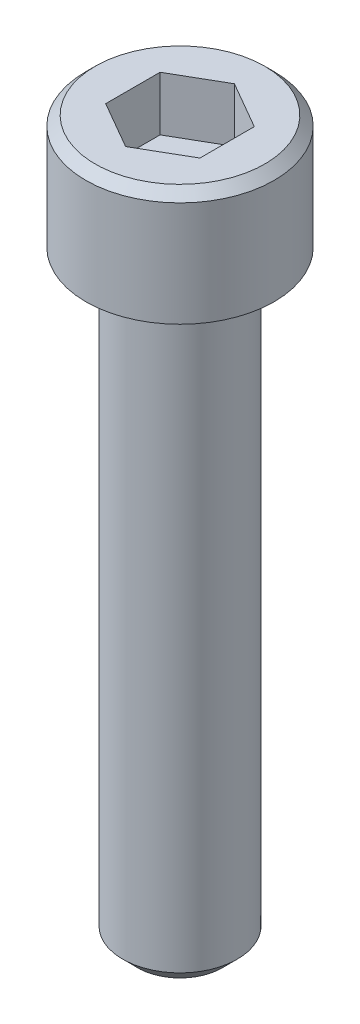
ISO-10303-21;
HEADER;
FILE_DESCRIPTION(('STEP AP214'),'2;1');
FILE_NAME('part.step','',(''),(''),'','','');
FILE_SCHEMA(('AUTOMOTIVE_DESIGN { 1 0 10303 214 1 1 1 1 }'));
ENDSEC;
DATA;
#1=APPLICATION_CONTEXT('core data for automotive mechanical design processes');
#2=APPLICATION_PROTOCOL_DEFINITION('international standard','automotive_design',2000,#1);
#3=PRODUCT_CONTEXT('',#1,'mechanical');
#4=PRODUCT('Part','Part','',(#3));
#5=PRODUCT_RELATED_PRODUCT_CATEGORY('part','',(#4));
#6=PRODUCT_DEFINITION_FORMATION('','',#4);
#7=PRODUCT_DEFINITION_CONTEXT('part definition',#1,'design');
#8=PRODUCT_DEFINITION('design','',#6,#7);
#9=PRODUCT_DEFINITION_SHAPE('','',#8);
#10=(LENGTH_UNIT() NAMED_UNIT(*) SI_UNIT(.MILLI.,.METRE.));
#11=(NAMED_UNIT(*) PLANE_ANGLE_UNIT() SI_UNIT($,.RADIAN.));
#12=(NAMED_UNIT(*) SI_UNIT($,.STERADIAN.) SOLID_ANGLE_UNIT());
#13=UNCERTAINTY_MEASURE_WITH_UNIT(LENGTH_MEASURE(1.E-05),#10,'distance_accuracy_value','');
#14=(GEOMETRIC_REPRESENTATION_CONTEXT(3) GLOBAL_UNCERTAINTY_ASSIGNED_CONTEXT((#13)) GLOBAL_UNIT_ASSIGNED_CONTEXT((#10,
#11,#12)) REPRESENTATION_CONTEXT('',''));
#15=CARTESIAN_POINT('',(0.,0.,0.));
#16=DIRECTION('',(0.,0.,1.));
#17=DIRECTION('',(1.,0.,0.));
#18=AXIS2_PLACEMENT_3D('',#15,#16,#17);
#19=CARTESIAN_POINT('',(0.,-1.38777878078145E-13,0.));
#20=DIRECTION('',(0.,-1.,0.));
#21=DIRECTION('',(0.,0.,-1.));
#22=AXIS2_PLACEMENT_3D('',#19,#20,#21);
#23=PLANE('',#22);
#24=CARTESIAN_POINT('',(0.,-1.38777878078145E-13,0.));
#25=DIRECTION('',(0.,-1.,0.));
#26=DIRECTION('',(0.,0.,-1.));
#27=AXIS2_PLACEMENT_3D('',#24,#25,#26);
#28=CIRCLE('',#27,2.413);
#29=CARTESIAN_POINT('',(0.,-1.38777878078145E-13,-2.41300000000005));
#30=VERTEX_POINT('',#29);
#31=EDGE_CURVE('E11',#30,#30,#28,.T.);
#32=ORIENTED_EDGE('',*,*,#31,.F.);
#33=EDGE_LOOP('',(#32));
#34=FACE_BOUND('',#33,.T.);
#35=CARTESIAN_POINT('',(0.,-1.38777878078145E-13,0.));
#36=DIRECTION('',(0.,-1.,0.));
#37=DIRECTION('',(0.,0.,-1.));
#38=AXIS2_PLACEMENT_3D('',#35,#36,#37);
#39=CIRCLE('',#38,3.96875);
#40=CARTESIAN_POINT('',(0.,-1.38777878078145E-13,-3.96875000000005));
#41=VERTEX_POINT('',#40);
#42=EDGE_CURVE('E39',#41,#41,#39,.T.);
#43=ORIENTED_EDGE('',*,*,#42,.T.);
#44=EDGE_LOOP('',(#43));
#45=FACE_BOUND('',#44,.T.);
#46=ADVANCED_FACE('F32',(#34,#45),#23,.T.);
#47=CARTESIAN_POINT('',(0.,-1.38777878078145E-13,0.));
#48=DIRECTION('',(0.,-1.,0.));
#49=DIRECTION('',(0.,0.,-1.));
#50=AXIS2_PLACEMENT_3D('',#47,#48,#49);
#51=CYLINDRICAL_SURFACE('',#50,3.96875);
#52=CARTESIAN_POINT('',(0.,4.42912499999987,0.));
#53=DIRECTION('',(0.,-1.,0.));
#54=DIRECTION('',(0.,0.,-1.));
#55=AXIS2_PLACEMENT_3D('',#52,#53,#54);
#56=CIRCLE('',#55,3.96875);
#57=CARTESIAN_POINT('',(0.,4.42912499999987,-3.96875000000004));
#58=VERTEX_POINT('',#57);
#59=EDGE_CURVE('E149',#58,#58,#56,.T.);
#60=ORIENTED_EDGE('',*,*,#59,.T.);
#61=EDGE_LOOP('',(#60));
#62=FACE_BOUND('',#61,.T.);
#63=ORIENTED_EDGE('',*,*,#42,.F.);
#64=EDGE_LOOP('',(#63));
#65=FACE_BOUND('',#64,.T.);
#66=ADVANCED_FACE('F155',(#62,#65),#51,.T.);
#67=CARTESIAN_POINT('',(0.,4.42912499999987,0.));
#68=DIRECTION('',(0.,-1.,0.));
#69=DIRECTION('',(0.,0.,-1.));
#70=AXIS2_PLACEMENT_3D('',#67,#68,#69);
#71=CONICAL_SURFACE('',#70,3.96875,0.785398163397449);
#72=CARTESIAN_POINT('',(0.,4.82599999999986,0.));
#73=DIRECTION('',(0.,-1.,0.));
#74=DIRECTION('',(0.,0.,-1.));
#75=AXIS2_PLACEMENT_3D('',#72,#73,#74);
#76=CIRCLE('',#75,3.571875);
#77=CARTESIAN_POINT('',(0.,4.82599999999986,-3.57187500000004));
#78=VERTEX_POINT('',#77);
#79=EDGE_CURVE('E146',#78,#78,#76,.T.);
#80=ORIENTED_EDGE('',*,*,#79,.T.);
#81=EDGE_LOOP('',(#80));
#82=FACE_BOUND('',#81,.T.);
#83=ORIENTED_EDGE('',*,*,#59,.F.);
#84=EDGE_LOOP('',(#83));
#85=FACE_BOUND('',#84,.T.);
#86=ADVANCED_FACE('F157',(#82,#85),#71,.T.);
#87=CARTESIAN_POINT('',(3.57187500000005,4.82599999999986,-1.35308431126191E-13));
#88=DIRECTION('',(0.,1.,0.));
#89=DIRECTION('',(0.,0.,1.));
#90=AXIS2_PLACEMENT_3D('',#87,#88,#89);
#91=PLANE('',#90);
#92=DIRECTION('',(1.02072794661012E-11,0.,1.));
#93=VECTOR('',#92,1.);
#94=CARTESIAN_POINT('',(-1.98501000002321,4.82599999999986,-1.14604605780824));
#95=LINE('',#94,#93);
#96=CARTESIAN_POINT('',(-1.98501000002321,4.82599999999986,-1.14604605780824));
#97=VERTEX_POINT('',#96);
#98=CARTESIAN_POINT('',(-1.98501000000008,4.82599999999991,1.14604605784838));
#99=VERTEX_POINT('',#98);
#100=EDGE_CURVE('E46',#97,#99,#95,.T.);
#101=ORIENTED_EDGE('',*,*,#100,.F.);
#102=DIRECTION('',(-0.866025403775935,0.,0.500000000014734));
#103=VECTOR('',#102,1.);
#104=CARTESIAN_POINT('',(-3.50969253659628E-11,4.82599999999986,-2.29209211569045));
#105=LINE('',#104,#103);
#106=CARTESIAN_POINT('',(-3.50969253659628E-11,4.82599999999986,-2.29209211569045));
#107=VERTEX_POINT('',#106);
#108=EDGE_CURVE('E116',#107,#97,#105,.T.);
#109=ORIENTED_EDGE('',*,*,#108,.F.);
#110=DIRECTION('',(-0.866025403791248,0.,-0.499999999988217));
#111=VECTOR('',#110,1.);
#112=CARTESIAN_POINT('',(1.9850099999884,4.82599999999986,-1.14604605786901));
#113=LINE('',#112,#111);
#114=CARTESIAN_POINT('',(1.9850099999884,4.82599999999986,-1.14604605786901));
#115=VERTEX_POINT('',#114);
#116=EDGE_CURVE('E110',#115,#107,#113,.T.);
#117=ORIENTED_EDGE('',*,*,#116,.F.);
#118=DIRECTION('',(-1.02072794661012E-11,0.,-1.));
#119=VECTOR('',#118,1.);
#120=CARTESIAN_POINT('',(1.9850100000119,4.82599999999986,1.14604605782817));
#121=LINE('',#120,#119);
#122=CARTESIAN_POINT('',(1.9850100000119,4.82599999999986,1.14604605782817));
#123=VERTEX_POINT('',#122);
#124=EDGE_CURVE('E108',#123,#115,#121,.T.);
#125=ORIENTED_EDGE('',*,*,#124,.F.);
#126=DIRECTION('',(0.866025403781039,0.,-0.500000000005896));
#127=VECTOR('',#126,1.);
#128=CARTESIAN_POINT('',(1.18984683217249E-11,4.82600000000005,2.29209211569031));
#129=LINE('',#128,#127);
#130=CARTESIAN_POINT('',(1.18984683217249E-11,4.82600000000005,2.29209211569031));
#131=VERTEX_POINT('',#130);
#132=EDGE_CURVE('E89',#131,#123,#129,.T.);
#133=ORIENTED_EDGE('',*,*,#132,.F.);
#134=DIRECTION('',(0.866025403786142,0.,0.499999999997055));
#135=VECTOR('',#134,1.);
#136=CARTESIAN_POINT('',(-1.98501000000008,4.82599999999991,1.14604605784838));
#137=LINE('',#136,#135);
#138=EDGE_CURVE('E100',#99,#131,#137,.T.);
#139=ORIENTED_EDGE('',*,*,#138,.F.);
#140=EDGE_LOOP('',(#101,#109,#117,#125,#133,#139));
#141=FACE_BOUND('',#140,.T.);
#142=ORIENTED_EDGE('',*,*,#79,.F.);
#143=EDGE_LOOP('',(#142));
#144=FACE_BOUND('',#143,.T.);
#145=ADVANCED_FACE('F104',(#141,#144),#91,.T.);
#146=CARTESIAN_POINT('',(0.,-25.4000000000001,0.));
#147=DIRECTION('',(0.,-1.,0.));
#148=DIRECTION('',(0.,0.,-1.));
#149=AXIS2_PLACEMENT_3D('',#146,#147,#148);
#150=PLANE('',#149);
#151=CARTESIAN_POINT('',(0.,-25.4000000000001,0.));
#152=DIRECTION('',(0.,-1.,0.));
#153=DIRECTION('',(0.,0.,-1.));
#154=AXIS2_PLACEMENT_3D('',#151,#152,#153);
#155=CIRCLE('',#154,1.78308000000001);
#156=CARTESIAN_POINT('',(0.,-25.4000000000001,-1.78307999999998));
#157=VERTEX_POINT('',#156);
#158=EDGE_CURVE('E143',#157,#157,#155,.T.);
#159=ORIENTED_EDGE('',*,*,#158,.T.);
#160=EDGE_LOOP('',(#159));
#161=FACE_BOUND('',#160,.T.);
#162=ADVANCED_FACE('F169',(#161),#150,.T.);
#163=CARTESIAN_POINT('',(0.,-25.4000000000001,0.));
#164=DIRECTION('',(0.,1.,0.));
#165=DIRECTION('',(0.,0.,1.));
#166=AXIS2_PLACEMENT_3D('',#163,#164,#165);
#167=CONICAL_SURFACE('',#166,1.78308000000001,0.785398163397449);
#168=CARTESIAN_POINT('',(0.,-24.7700800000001,0.));
#169=DIRECTION('',(0.,-1.,0.));
#170=DIRECTION('',(0.,0.,-1.));
#171=AXIS2_PLACEMENT_3D('',#168,#169,#170);
#172=CIRCLE('',#171,2.413);
#173=CARTESIAN_POINT('',(0.,-24.7700800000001,-2.41299999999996));
#174=VERTEX_POINT('',#173);
#175=EDGE_CURVE('E134',#174,#174,#172,.T.);
#176=ORIENTED_EDGE('',*,*,#175,.T.);
#177=EDGE_LOOP('',(#176));
#178=FACE_BOUND('',#177,.T.);
#179=ORIENTED_EDGE('',*,*,#158,.F.);
#180=EDGE_LOOP('',(#179));
#181=FACE_BOUND('',#180,.T.);
#182=ADVANCED_FACE('F172',(#178,#181),#167,.T.);
#183=CARTESIAN_POINT('',(0.,-1.38777878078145E-13,0.));
#184=DIRECTION('',(0.,-1.,0.));
#185=DIRECTION('',(0.,0.,-1.));
#186=AXIS2_PLACEMENT_3D('',#183,#184,#185);
#187=CYLINDRICAL_SURFACE('',#186,2.413);
#188=ORIENTED_EDGE('',*,*,#31,.T.);
#189=EDGE_LOOP('',(#188));
#190=FACE_BOUND('',#189,.T.);
#191=ORIENTED_EDGE('',*,*,#175,.F.);
#192=EDGE_LOOP('',(#191));
#193=FACE_BOUND('',#192,.T.);
#194=ADVANCED_FACE('F176',(#190,#193),#187,.T.);
#195=CARTESIAN_POINT('',(-1.98501000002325,2.53999999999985,-1.14604605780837));
#196=DIRECTION('',(-1.,0.,1.02072794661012E-11));
#197=DIRECTION('',(1.02072794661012E-11,0.,1.));
#198=AXIS2_PLACEMENT_3D('',#195,#196,#197);
#199=PLANE('',#198);
#200=ORIENTED_EDGE('',*,*,#100,.T.);
#201=DIRECTION('',(0.,1.,0.));
#202=VECTOR('',#201,1.);
#203=CARTESIAN_POINT('',(-1.98501000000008,2.5399999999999,1.14604605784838));
#204=LINE('',#203,#202);
#205=CARTESIAN_POINT('',(-1.98501000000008,2.5399999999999,1.14604605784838));
#206=VERTEX_POINT('',#205);
#207=EDGE_CURVE('E97',#206,#99,#204,.T.);
#208=ORIENTED_EDGE('',*,*,#207,.F.);
#209=DIRECTION('',(1.02072794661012E-11,0.,1.));
#210=VECTOR('',#209,1.);
#211=CARTESIAN_POINT('',(-1.98501000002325,2.53999999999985,-1.14604605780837));
#212=LINE('',#211,#210);
#213=CARTESIAN_POINT('',(-1.98501000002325,2.53999999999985,-1.14604605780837));
#214=VERTEX_POINT('',#213);
#215=EDGE_CURVE('E118',#214,#206,#212,.T.);
#216=ORIENTED_EDGE('',*,*,#215,.F.);
#217=DIRECTION('',(0.,1.,0.));
#218=VECTOR('',#217,1.);
#219=CARTESIAN_POINT('',(-1.98501000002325,2.53999999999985,-1.14604605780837));
#220=LINE('',#219,#218);
#221=EDGE_CURVE('E53',#214,#97,#220,.T.);
#222=ORIENTED_EDGE('',*,*,#221,.T.);
#223=EDGE_LOOP('',(#200,#208,#216,#222));
#224=FACE_BOUND('',#223,.T.);
#225=ADVANCED_FACE('F180',(#224),#199,.F.);
#226=CARTESIAN_POINT('',(-3.50691697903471E-11,2.53999999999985,-2.29209211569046));
#227=DIRECTION('',(-0.500000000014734,0.,-0.866025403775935));
#228=DIRECTION('',(-0.866025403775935,0.,0.500000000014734));
#229=AXIS2_PLACEMENT_3D('',#226,#227,#228);
#230=PLANE('',#229);
#231=ORIENTED_EDGE('',*,*,#108,.T.);
#232=ORIENTED_EDGE('',*,*,#221,.F.);
#233=DIRECTION('',(-0.866025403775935,0.,0.500000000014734));
#234=VECTOR('',#233,1.);
#235=CARTESIAN_POINT('',(-3.50691697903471E-11,2.53999999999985,-2.29209211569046));
#236=LINE('',#235,#234);
#237=CARTESIAN_POINT('',(-3.50691697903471E-11,2.53999999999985,-2.29209211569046));
#238=VERTEX_POINT('',#237);
#239=EDGE_CURVE('E130',#238,#214,#236,.T.);
#240=ORIENTED_EDGE('',*,*,#239,.F.);
#241=DIRECTION('',(0.,1.,0.));
#242=VECTOR('',#241,1.);
#243=CARTESIAN_POINT('',(-3.50691697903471E-11,2.53999999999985,-2.29209211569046));
#244=LINE('',#243,#242);
#245=EDGE_CURVE('E135',#238,#107,#244,.T.);
#246=ORIENTED_EDGE('',*,*,#245,.T.);
#247=EDGE_LOOP('',(#231,#232,#240,#246));
#248=FACE_BOUND('',#247,.T.);
#249=ADVANCED_FACE('F184',(#248),#230,.F.);
#250=CARTESIAN_POINT('',(1.9850099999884,2.53999999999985,-1.14604605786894));
#251=DIRECTION('',(0.499999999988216,0.,-0.866025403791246));
#252=DIRECTION('',(-0.866025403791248,0.,-0.499999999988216));
#253=AXIS2_PLACEMENT_3D('',#250,#251,#252);
#254=PLANE('',#253);
#255=ORIENTED_EDGE('',*,*,#116,.T.);
#256=ORIENTED_EDGE('',*,*,#245,.F.);
#257=DIRECTION('',(-0.866025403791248,0.,-0.499999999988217));
#258=VECTOR('',#257,1.);
#259=CARTESIAN_POINT('',(1.9850099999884,2.53999999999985,-1.14604605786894));
#260=LINE('',#259,#258);
#261=CARTESIAN_POINT('',(1.9850099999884,2.53999999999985,-1.14604605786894));
#262=VERTEX_POINT('',#261);
#263=EDGE_CURVE('E127',#262,#238,#260,.T.);
#264=ORIENTED_EDGE('',*,*,#263,.F.);
#265=DIRECTION('',(0.,1.,0.));
#266=VECTOR('',#265,1.);
#267=CARTESIAN_POINT('',(1.9850099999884,2.53999999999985,-1.14604605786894));
#268=LINE('',#267,#266);
#269=EDGE_CURVE('E137',#262,#115,#268,.T.);
#270=ORIENTED_EDGE('',*,*,#269,.T.);
#271=EDGE_LOOP('',(#255,#256,#264,#270));
#272=FACE_BOUND('',#271,.T.);
#273=ADVANCED_FACE('F193',(#272),#254,.F.);
#274=CARTESIAN_POINT('',(1.985010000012,2.53999999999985,1.14604605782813));
#275=DIRECTION('',(1.,0.,-1.02072794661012E-11));
#276=DIRECTION('',(-1.02072794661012E-11,0.,-1.));
#277=AXIS2_PLACEMENT_3D('',#274,#275,#276);
#278=PLANE('',#277);
#279=ORIENTED_EDGE('',*,*,#124,.T.);
#280=ORIENTED_EDGE('',*,*,#269,.F.);
#281=DIRECTION('',(-1.02072794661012E-11,0.,-1.));
#282=VECTOR('',#281,1.);
#283=CARTESIAN_POINT('',(1.985010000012,2.53999999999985,1.14604605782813));
#284=LINE('',#283,#282);
#285=CARTESIAN_POINT('',(1.985010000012,2.53999999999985,1.14604605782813));
#286=VERTEX_POINT('',#285);
#287=EDGE_CURVE('E124',#286,#262,#284,.T.);
#288=ORIENTED_EDGE('',*,*,#287,.F.);
#289=DIRECTION('',(0.,1.,0.));
#290=VECTOR('',#289,1.);
#291=CARTESIAN_POINT('',(1.985010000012,2.53999999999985,1.14604605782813));
#292=LINE('',#291,#290);
#293=EDGE_CURVE('E96',#286,#123,#292,.T.);
#294=ORIENTED_EDGE('',*,*,#293,.T.);
#295=EDGE_LOOP('',(#279,#280,#288,#294));
#296=FACE_BOUND('',#295,.T.);
#297=ADVANCED_FACE('F190',(#296),#278,.F.);
#298=CARTESIAN_POINT('',(1.19054072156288E-11,2.54000000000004,2.29209211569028));
#299=DIRECTION('',(0.500000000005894,0.,0.866025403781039));
#300=DIRECTION('',(0.866025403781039,0.,-0.500000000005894));
#301=AXIS2_PLACEMENT_3D('',#298,#299,#300);
#302=PLANE('',#301);
#303=ORIENTED_EDGE('',*,*,#132,.T.);
#304=ORIENTED_EDGE('',*,*,#293,.F.);
#305=DIRECTION('',(0.866025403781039,0.,-0.500000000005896));
#306=VECTOR('',#305,1.);
#307=CARTESIAN_POINT('',(1.19054072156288E-11,2.54000000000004,2.29209211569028));
#308=LINE('',#307,#306);
#309=CARTESIAN_POINT('',(1.19054072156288E-11,2.54000000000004,2.29209211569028));
#310=VERTEX_POINT('',#309);
#311=EDGE_CURVE('E92',#310,#286,#308,.T.);
#312=ORIENTED_EDGE('',*,*,#311,.F.);
#313=DIRECTION('',(0.,1.,0.));
#314=VECTOR('',#313,1.);
#315=CARTESIAN_POINT('',(1.19054072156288E-11,2.54000000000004,2.29209211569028));
#316=LINE('',#315,#314);
#317=EDGE_CURVE('E85',#310,#131,#316,.T.);
#318=ORIENTED_EDGE('',*,*,#317,.T.);
#319=EDGE_LOOP('',(#303,#304,#312,#318));
#320=FACE_BOUND('',#319,.T.);
#321=ADVANCED_FACE('F87',(#320),#302,.F.);
#322=CARTESIAN_POINT('',(-1.98501000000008,2.5399999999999,1.14604605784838));
#323=DIRECTION('',(-0.499999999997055,0.,0.866025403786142));
#324=DIRECTION('',(0.866025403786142,0.,0.499999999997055));
#325=AXIS2_PLACEMENT_3D('',#322,#323,#324);
#326=PLANE('',#325);
#327=ORIENTED_EDGE('',*,*,#138,.T.);
#328=ORIENTED_EDGE('',*,*,#317,.F.);
#329=DIRECTION('',(0.866025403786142,0.,0.499999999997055));
#330=VECTOR('',#329,1.);
#331=CARTESIAN_POINT('',(-1.98501000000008,2.5399999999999,1.14604605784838));
#332=LINE('',#331,#330);
#333=EDGE_CURVE('E121',#206,#310,#332,.T.);
#334=ORIENTED_EDGE('',*,*,#333,.F.);
#335=ORIENTED_EDGE('',*,*,#207,.T.);
#336=EDGE_LOOP('',(#327,#328,#334,#335));
#337=FACE_BOUND('',#336,.T.);
#338=ADVANCED_FACE('F101',(#337),#326,.F.);
#339=CARTESIAN_POINT('',(-1.98501000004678,2.53999999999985,-3.4381381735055));
#340=DIRECTION('',(0.,-1.,0.));
#341=DIRECTION('',(0.,0.,-1.));
#342=AXIS2_PLACEMENT_3D('',#339,#340,#341);
#343=PLANE('',#342);
#344=ORIENTED_EDGE('',*,*,#215,.T.);
#345=ORIENTED_EDGE('',*,*,#333,.T.);
#346=ORIENTED_EDGE('',*,*,#311,.T.);
#347=ORIENTED_EDGE('',*,*,#287,.T.);
#348=ORIENTED_EDGE('',*,*,#263,.T.);
#349=ORIENTED_EDGE('',*,*,#239,.T.);
#350=EDGE_LOOP('',(#344,#345,#346,#347,#348,#349));
#351=FACE_BOUND('',#350,.T.);
#352=ADVANCED_FACE('F187',(#351),#343,.F.);
#353=CLOSED_SHELL('',(#46,#66,#86,#145,#162,#182,#194,#225,#249,#273,#297,#321,#338,#352));
#354=MANIFOLD_SOLID_BREP('B2',#353);
#355=ADVANCED_BREP_SHAPE_REPRESENTATION('',(#18,#354),#14);
#356=SHAPE_DEFINITION_REPRESENTATION(#9,#355);
ENDSEC;
END-ISO-10303-21;
